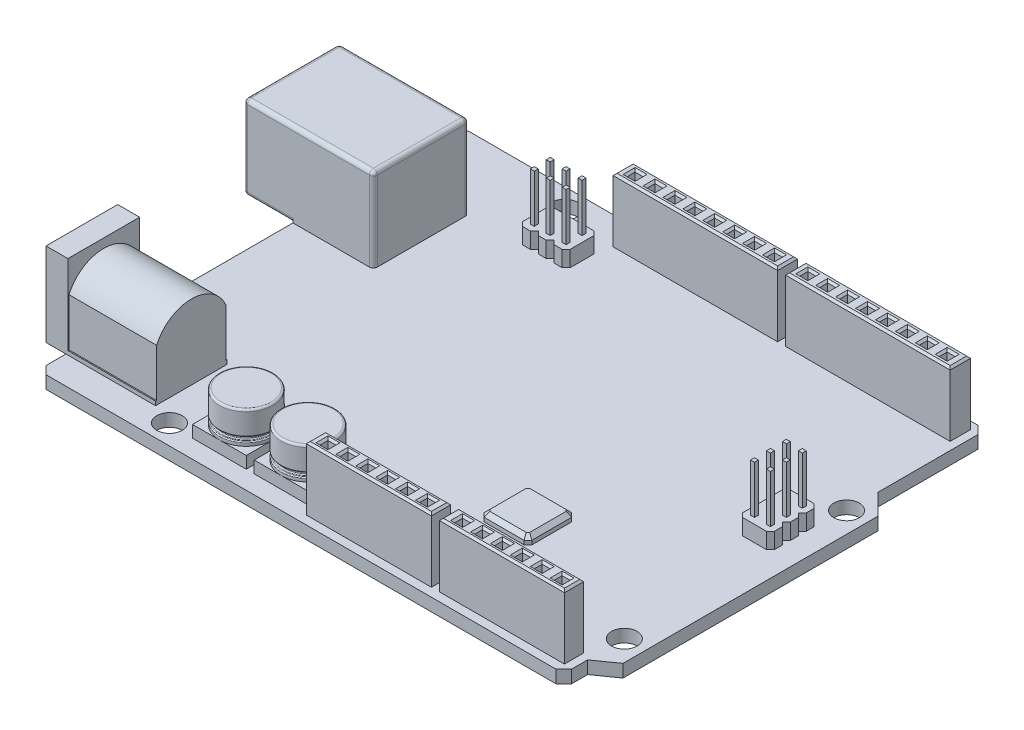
from build123d import *

# Parameters (mm, degrees)
SKETCH1_R           = 1.6
BOSS_EXTRUDE1_DEPTH = 1.6
CHAMFER1_SIZE       = 1
SKETCH2_W           = 16.3
SKETCH2_H           = 12
SKETCH2_W_2         = 13.75
SKETCH2_H_2         = 9
BOSS_EXTRUDE2_DEPTH = 10.5
CUT_EXTRUDE1_DEPTH  = 10
FILLET2_R           = 0.5
SKETCH4_R           = 3.5
SKETCH4_R_2         = 0.5
CUT_EXTRUDE2_DEPTH  = 10
CUT_EXTRUDE5_DEPTH  = 11
FILLET3_R           = 0.5
SKETCH7_W           = 20.65
SKETCH7_H           = 2.5
SKETCH7_W_2         = 1
SKETCH7_H_2         = 1
SKETCH7_H_3         = 2.565649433
SKETCH7_W_3         = 15.7
SKETCH7_H_4         = 2.414728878
BOSS_EXTRUDE3_DEPTH = 8
CHAMFER2_SIZE       = 0.25
SKETCH8_W           = 6.75
SKETCH8_H           = 6.75
BOSS_EXTRUDE4_DEPTH = 1.5
SKETCH9_R           = 3.375
BOSS_EXTRUDE5_DEPTH = 4
FILLET4_R           = 0.25
CUT_EXTRUDE6_START  = -0.5
SKETCH10_R          = 3.375
SKETCH10_R_2        = 3
CUT_EXTRUDE6_DEPTH  = 0.5
FILLET5_R           = 0.125
BOSS_EXTRUDE6_DEPTH = 2
SKETCH12_W          = 0.5
SKETCH12_H          = 0.5
BOSS_EXTRUDE7_DEPTH = 6
SKETCH13_W          = 6
SKETCH13_H          = 6
BOSS_EXTRUDE8_DEPTH = 1
CHAMFER3_SIZE       = 0.5
CHAMFER4_SIZE       = 0.5


with BuildPart() as part:
    # Sketch1 → Boss-Extrude1 (new body)
    with BuildSketch(Plane(origin=(0, 0, 0), x_dir=(1, 0, 0), z_dir=(0, 1, 0))):
        Polygon((33, 12.933424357), (35.6, 10.333424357), (35.6, -21.666575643), (33, -23.5), (33, -26.5), (-33, -26.5), (-33, 26.5), (33, 26.5), align=None)
        with Locations(Location((-17.4, 24, 0), (0, 0, 270))):
            Circle(SKETCH1_R, mode=Mode.SUBTRACT)
        with Locations(Location((-19, -24, 0), (0, 0, 270))):
            Circle(SKETCH1_R, mode=Mode.SUBTRACT)
        with Locations(Location((33, 9, 0), (0, 0, 270))):
            Circle(SKETCH1_R, mode=Mode.SUBTRACT)
        with Locations(Location((33, -18.9, 0), (0, 0, 270))):
            Circle(SKETCH1_R, mode=Mode.SUBTRACT)
    extrude(amount=BOSS_EXTRUDE1_DEPTH)

    # Chamfer1
    chamfer1_edges = [part.edges().sort_by_distance(p)[0] for p in [
        (33, 0.8, 26.5),
        (-33, 0.8, 26.5),
        (-33, 0.8, -26.5),
        (33, 0.8, -26.5),
    ]]
    chamfer(chamfer1_edges, length=CHAMFER1_SIZE)

    # Sketch2 → Boss-Extrude2 (add)
    with BuildSketch(Plane(origin=(0, 1.6, 0), x_dir=(1, 0, 0), z_dir=(0, 1, 0))):
        with Locations((-31.05, 11.5)):
            Rectangle(SKETCH2_W, SKETCH2_H)
        with Locations((-28.625, -18.5)):
            Rectangle(SKETCH2_W_2, SKETCH2_H_2)
    extrude(amount=BOSS_EXTRUDE2_DEPTH)

    # Sketch3 → Cut-Extrude1 (cut)
    with BuildSketch(Plane.ZY.offset(39.2)):
        Polygon((-9.160529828, 10.6), (-13.839470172, 10.6), (-16, 8.151795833), (-16, 3.1), (-7, 3.1), (-7, 8.151795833), align=None)
        Polygon((-8.81, 8.151795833), (-14.19, 8.151795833), (-14.19, 5.651795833), (-11.5, 5.651795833), (-8.81, 5.651795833), align=None, mode=Mode.SUBTRACT)
    extrude(amount=-CUT_EXTRUDE1_DEPTH, mode=Mode.SUBTRACT)

    # Fillet2
    fillet2_edges = [part.edges().sort_by_distance(p)[0] for p in [
        (-36.1, 1.6, -17.5),
        (-39.2, 1.6, -11.5),
        (-36.1, 1.6, -5.5),
        (-22.9, 12.1, -11.5),
        (-31.05, 12.1, -17.5),
        (-39.2, 12.1, -11.5),
        (-22.9, 6.85, -5.5),
        (-39.2, 6.85, -5.5),
        (-39.2, 6.85, -17.5),
        (-22.9, 6.85, -17.5),
        (-31.05, 12.1, -5.5),
    ]]
    fillet(fillet2_edges, radius=FILLET2_R)

    # Sketch4 → Cut-Extrude2 (cut)
    with BuildSketch(Plane.ZY.offset(35.5)):
        with Locations((18.5, 6.85)):
            Circle(SKETCH4_R)
        with Locations((18.5, 6.85)):
            Circle(SKETCH4_R_2, mode=Mode.SUBTRACT)
    extrude(amount=-CUT_EXTRUDE2_DEPTH, mode=Mode.SUBTRACT)

    # Sketch6 → Cut-Extrude5 (cut)
    with BuildSketch(Plane(origin=(-21.75, 0, 0), x_dir=(0, 0, -1), z_dir=(1, 0, 0))):
        with BuildLine():
            Line((-14, 12.1), (-23, 12.1))
            Line((-23, 12.1), (-23, 2.1))
            Line((-23, 2.1), (-22.86, 2.1))
            Line((-22.86, 2.1), (-22.86, 8.1))
            ThreePointArc((-22.86, 8.1), (-18.5, 10.959725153), (-14.14, 8.1))
            Line((-14.14, 8.1), (-14.14, 2.1))
            Line((-14.14, 2.1), (-14, 2.1))
            Line((-14, 2.1), (-14, 12.1))
        make_face()
    extrude(amount=-CUT_EXTRUDE5_DEPTH, mode=Mode.SUBTRACT)

    # Fillet3
    fillet3_edges = [part.edges().sort_by_distance(p)[0] for p in [
        (-35.5, 6.85, 18),
    ]]
    fillet(fillet3_edges, radius=FILLET3_R)

    # Sketch7 → Boss-Extrude3 (add)
    # profile 1 of 4: a face of its own
    with BuildSketch(Plane(origin=(0, 1.6, 0), x_dir=(1, 0, 0), z_dir=(0, 1, 0))):
        with Locations((0.025, 24.25)):
            Rectangle(SKETCH7_W, SKETCH7_H)
        with Locations((-6.3, 24.25)):
            Rectangle(SKETCH7_W_2, SKETCH7_H_2, mode=Mode.SUBTRACT)
        with Locations((-8.8, 24.25)):
            Rectangle(SKETCH7_W_2, SKETCH7_H_2, mode=Mode.SUBTRACT)
        with Locations((-3.8, 24.25)):
            Rectangle(SKETCH7_W_2, SKETCH7_H_2, mode=Mode.SUBTRACT)
        with Locations((-1.3, 24.25)):
            Rectangle(SKETCH7_W_2, SKETCH7_H_2, mode=Mode.SUBTRACT)
        with Locations((1.2, 24.25)):
            Rectangle(SKETCH7_W_2, SKETCH7_H_2, mode=Mode.SUBTRACT)
        with Locations((3.7, 24.25)):
            Rectangle(SKETCH7_W_2, SKETCH7_H_2, mode=Mode.SUBTRACT)
        with Locations((6.2, 24.25)):
            Rectangle(SKETCH7_W_2, SKETCH7_H_2, mode=Mode.SUBTRACT)
        with Locations((8.7, 24.25)):
            Rectangle(SKETCH7_W_2, SKETCH7_H_2, mode=Mode.SUBTRACT)
    # profile 2 of 4: a face of its own
    with BuildSketch(Plane(origin=(0, 1.6, 0), x_dir=(1, 0, 0), z_dir=(0, 1, 0))):
        with Locations((21.675, 24.282824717)):
            Rectangle(SKETCH7_W, SKETCH7_H_3)
        with Locations((15.35, 24.282824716)):
            Rectangle(SKETCH7_W_2, SKETCH7_H_2, mode=Mode.SUBTRACT)
        with Locations((12.85, 24.282824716)):
            Rectangle(SKETCH7_W_2, SKETCH7_H_2, mode=Mode.SUBTRACT)
        with Locations((17.85, 24.282824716)):
            Rectangle(SKETCH7_W_2, SKETCH7_H_2, mode=Mode.SUBTRACT)
        with Locations((20.35, 24.282824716)):
            Rectangle(SKETCH7_W_2, SKETCH7_H_2, mode=Mode.SUBTRACT)
        with Locations((22.85, 24.282824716)):
            Rectangle(SKETCH7_W_2, SKETCH7_H_2, mode=Mode.SUBTRACT)
        with Locations((25.35, 24.282824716)):
            Rectangle(SKETCH7_W_2, SKETCH7_H_2, mode=Mode.SUBTRACT)
        with Locations((27.85, 24.282824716)):
            Rectangle(SKETCH7_W_2, SKETCH7_H_2, mode=Mode.SUBTRACT)
        with Locations((30.35, 24.282824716)):
            Rectangle(SKETCH7_W_2, SKETCH7_H_2, mode=Mode.SUBTRACT)
    # profile 3 of 4: a face of its own
    with BuildSketch(Plane(origin=(0, 1.6, 0), x_dir=(1, 0, 0), z_dir=(0, 1, 0))):
        with Locations((7.45, -24.207364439)):
            Rectangle(SKETCH7_W_3, SKETCH7_H_4)
        with Locations((3.6, -24.207364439)):
            Rectangle(SKETCH7_W_2, SKETCH7_H_2, mode=Mode.SUBTRACT)
        with Locations((1.1, -24.207364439)):
            Rectangle(SKETCH7_W_2, SKETCH7_H_2, mode=Mode.SUBTRACT)
        with Locations((6.1, -24.207364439)):
            Rectangle(SKETCH7_W_2, SKETCH7_H_2, mode=Mode.SUBTRACT)
        with Locations((8.6, -24.207364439)):
            Rectangle(SKETCH7_W_2, SKETCH7_H_2, mode=Mode.SUBTRACT)
        with Locations((11.1, -24.207364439)):
            Rectangle(SKETCH7_W_2, SKETCH7_H_2, mode=Mode.SUBTRACT)
        with Locations((13.6, -24.207364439)):
            Rectangle(SKETCH7_W_2, SKETCH7_H_2, mode=Mode.SUBTRACT)
    # profile 4 of 4: a face of its own
    with BuildSketch(Plane(origin=(0, 1.6, 0), x_dir=(1, 0, 0), z_dir=(0, 1, 0))):
        with Locations((24.15, -24.207364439)):
            Rectangle(SKETCH7_W_3, SKETCH7_H_4)
        with Locations((18, -24.207364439)):
            Rectangle(SKETCH7_W_2, SKETCH7_H_2, mode=Mode.SUBTRACT)
        with Locations((20.5, -24.207364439)):
            Rectangle(SKETCH7_W_2, SKETCH7_H_2, mode=Mode.SUBTRACT)
        with Locations((23, -24.207364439)):
            Rectangle(SKETCH7_W_2, SKETCH7_H_2, mode=Mode.SUBTRACT)
        with Locations((25.5, -24.207364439)):
            Rectangle(SKETCH7_W_2, SKETCH7_H_2, mode=Mode.SUBTRACT)
        with Locations((28, -24.207364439)):
            Rectangle(SKETCH7_W_2, SKETCH7_H_2, mode=Mode.SUBTRACT)
        with Locations((30.5, -24.207364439)):
            Rectangle(SKETCH7_W_2, SKETCH7_H_2, mode=Mode.SUBTRACT)
    extrude(amount=BOSS_EXTRUDE3_DEPTH)

    # Chamfer2
    chamfer2_edges = [part.edges().sort_by_distance(p)[0] for p in [
        (13.6, 9.6, 24.707364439),
        (14.1, 9.6, 24.207364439),
        (13.6, 9.6, 23.707364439),
        (13.1, 9.6, 24.207364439),
        (11.1, 9.6, 24.707364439),
        (11.6, 9.6, 24.207364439),
        (11.1, 9.6, 23.707364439),
        (10.6, 9.6, 24.207364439),
        (8.6, 9.6, 24.707364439),
        (9.1, 9.6, 24.207364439),
        (8.6, 9.6, 23.707364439),
        (8.1, 9.6, 24.207364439),
        (6.1, 9.6, 24.707364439),
        (6.6, 9.6, 24.207364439),
        (6.1, 9.6, 23.707364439),
        (5.6, 9.6, 24.207364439),
        (3.6, 9.6, 24.707364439),
        (4.1, 9.6, 24.207364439),
        (3.6, 9.6, 23.707364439),
        (3.1, 9.6, 24.207364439),
        (1.6, 9.6, 24.207364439),
        (1.1, 9.6, 23.707364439),
        (0.6, 9.6, 24.207364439),
        (1.1, 9.6, 24.707364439),
        (7.45, 9.6, 23),
        (15.3, 9.6, 24.207364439),
        (7.45, 9.6, 25.414728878),
        (-0.4, 9.6, 24.207364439),
        (30, 9.6, 24.207364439),
        (30.5, 9.6, 24.707364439),
        (31, 9.6, 24.207364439),
        (30.5, 9.6, 23.707364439),
        (27.5, 9.6, 24.207364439),
        (28, 9.6, 24.707364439),
        (28.5, 9.6, 24.207364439),
        (28, 9.6, 23.707364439),
        (25, 9.6, 24.207364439),
        (25.5, 9.6, 24.707364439),
        (26, 9.6, 24.207364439),
        (25.5, 9.6, 23.707364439),
        (22.5, 9.6, 24.207364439),
        (23, 9.6, 24.707364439),
        (23.5, 9.6, 24.207364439),
        (23, 9.6, 23.707364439),
        (20, 9.6, 24.207364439),
        (20.5, 9.6, 24.707364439),
        (21, 9.6, 24.207364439),
        (20.5, 9.6, 23.707364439),
        (17.5, 9.6, 24.207364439),
        (18, 9.6, 24.707364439),
        (18.5, 9.6, 24.207364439),
        (18, 9.6, 23.707364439),
        (24.15, 9.6, 23),
        (32, 9.6, 24.207364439),
        (24.15, 9.6, 25.414728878),
        (16.3, 9.6, 24.207364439),
        (30.35, 9.6, -23.782824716),
        (30.85, 9.6, -24.282824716),
        (30.35, 9.6, -24.782824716),
        (29.85, 9.6, -24.282824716),
        (27.85, 9.6, -23.782824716),
        (28.35, 9.6, -24.282824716),
        (27.85, 9.6, -24.782824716),
        (27.35, 9.6, -24.282824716),
        (25.35, 9.6, -23.782824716),
        (25.85, 9.6, -24.282824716),
        (25.35, 9.6, -24.782824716),
        (24.85, 9.6, -24.282824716),
        (22.85, 9.6, -23.782824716),
        (23.35, 9.6, -24.282824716),
        (22.85, 9.6, -24.782824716),
        (22.35, 9.6, -24.282824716),
        (20.35, 9.6, -23.782824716),
        (20.85, 9.6, -24.282824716),
        (20.35, 9.6, -24.782824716),
        (19.85, 9.6, -24.282824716),
        (17.85, 9.6, -23.782824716),
        (18.35, 9.6, -24.282824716),
        (17.85, 9.6, -24.782824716),
        (17.35, 9.6, -24.282824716),
        (15.35, 9.6, -23.782824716),
        (15.85, 9.6, -24.282824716),
        (15.35, 9.6, -24.782824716),
        (14.85, 9.6, -24.282824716),
        (13.35, 9.6, -24.282824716),
        (12.85, 9.6, -24.782824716),
        (12.35, 9.6, -24.282824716),
        (12.85, 9.6, -23.782824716),
        (21.675, 9.6, -25.565649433),
        (32, 9.6, -24.282824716),
        (21.675, 9.6, -23),
        (11.35, 9.6, -24.282824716),
        (8.7, 9.6, -23.75),
        (9.2, 9.6, -24.25),
        (8.7, 9.6, -24.75),
        (8.2, 9.6, -24.25),
        (6.2, 9.6, -23.75),
        (6.7, 9.6, -24.25),
        (6.2, 9.6, -24.75),
        (5.7, 9.6, -24.25),
        (3.7, 9.6, -23.75),
        (4.2, 9.6, -24.25),
        (3.7, 9.6, -24.75),
        (3.2, 9.6, -24.25),
        (1.2, 9.6, -23.75),
        (1.7, 9.6, -24.25),
        (1.2, 9.6, -24.75),
        (0.7, 9.6, -24.25),
        (-1.3, 9.6, -23.75),
        (-0.8, 9.6, -24.25),
        (-1.3, 9.6, -24.75),
        (-1.8, 9.6, -24.25),
        (-3.8, 9.6, -23.75),
        (-3.3, 9.6, -24.25),
        (-3.8, 9.6, -24.75),
        (-4.3, 9.6, -24.25),
        (-6.3, 9.6, -23.75),
        (-5.8, 9.6, -24.25),
        (-6.3, 9.6, -24.75),
        (-6.8, 9.6, -24.25),
        (-8.3, 9.6, -24.25),
        (-8.8, 9.6, -24.75),
        (-9.3, 9.6, -24.25),
        (-8.8, 9.6, -23.75),
        (0.025, 9.6, -25.5),
        (10.35, 9.6, -24.25),
        (0.025, 9.6, -23),
        (-10.3, 9.6, -24.25),
    ]]
    chamfer(chamfer2_edges, length=CHAMFER2_SIZE)

    # Sketch8 → Boss-Extrude4 (add)
    with BuildSketch(Plane(origin=(0, 1.6, 0), x_dir=(1, 0, 0), z_dir=(0, 1, 0))):
        with Locations((-4.775, -20.832364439)):
            Rectangle(SKETCH8_W, SKETCH8_H)
        with Locations((-12.525, -20.832364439)):
            Rectangle(SKETCH8_W, SKETCH8_H)
    extrude(amount=BOSS_EXTRUDE4_DEPTH)

    # Sketch9 → Boss-Extrude5 (add)
    with BuildSketch(Plane(origin=(0, 3.1, 0), x_dir=(1, 0, 0), z_dir=(0, 1, 0))):
        with Locations(Location((-12.525, -20.832364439, 0), (0, 0, 270))):
            Circle(SKETCH9_R)
        with Locations(Location((-4.775, -20.832364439, 0), (0, 0, 270))):
            Circle(SKETCH9_R)
    extrude(amount=BOSS_EXTRUDE5_DEPTH)

    # Fillet4
    fillet4_edges = [part.edges().sort_by_distance(p)[0] for p in [
        (-12.525, 7.1, 17.457364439),
        (-4.775, 7.1, 17.457364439),
    ]]
    fillet(fillet4_edges, radius=FILLET4_R)

    # Sketch10 → Cut-Extrude6 (cut)
    # profile 1 of 2: a face of its own
    with BuildSketch(Plane(origin=(0, 4.1, 0), x_dir=(1, 0, 0), z_dir=(0, 1, 0)).offset(CUT_EXTRUDE6_START)):
        with Locations(Location((-4.775, -20.832364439, 0), (0, 0, 270))):
            Circle(SKETCH10_R)
        with Locations(Location((-4.775, -20.832364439, 0), (0, 0, 270))):
            Circle(SKETCH10_R_2, mode=Mode.SUBTRACT)
    # profile 2 of 2: a face of its own
    with BuildSketch(Plane(origin=(0, 4.1, 0), x_dir=(1, 0, 0), z_dir=(0, 1, 0)).offset(CUT_EXTRUDE6_START)):
        with Locations(Location((-12.525, -20.832364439, 0), (0, 0, 90))):
            Circle(SKETCH10_R)
        with Locations(Location((-12.525, -20.832364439, 0), (0, 0, 90))):
            Circle(SKETCH10_R_2, mode=Mode.SUBTRACT)
    extrude(amount=CUT_EXTRUDE6_DEPTH, mode=Mode.SUBTRACT)

    # Fillet5
    fillet5_edges = [part.edges().sort_by_distance(p)[0] for p in [
        (-4.775, 3.6, 17.457364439),
        (-4.775, 3.6, 17.832364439),
        (-4.775, 4.1, 17.457364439),
        (-4.775, 4.1, 17.832364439),
        (-12.525, 3.6, 17.457364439),
        (-12.525, 3.6, 23.832364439),
        (-12.525, 4.1, 17.457364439),
        (-12.525, 4.1, 23.832364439),
    ]]
    fillet(fillet5_edges, radius=FILLET5_R)

    # Sketch11 → Boss-Extrude6 (add)
    with BuildSketch(Plane(origin=(0, 1.6, 0), x_dir=(1, 0, 0), z_dir=(0, 1, 0))):
        Polygon((29.239442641, 5.700694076), (28.739442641, 5.200694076), (28.739442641, 4.200694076), (29.239442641, 3.700694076), (28.739442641, 3.200694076), (28.739442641, 2.200694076), (29.239442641, 1.700694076), (28.739442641, 1.200694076), (28.739442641, 0.200694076), (29.239442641, -0.299305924), (32.239442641, -0.299305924), (32.739442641, 0.200694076), (32.739442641, 1.200694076), (32.239442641, 1.700694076), (32.739442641, 2.200694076), (32.739442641, 3.200694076), (32.239442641, 3.700694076), (32.739442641, 4.200694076), (32.739442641, 5.200694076), (32.239442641, 5.700694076), align=None)
        Polygon((-16.231707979, 21.527662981), (-16.731707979, 21.027662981), (-16.731707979, 18.027662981), (-16.231707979, 17.527662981), (-15.231707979, 17.527662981), (-14.731707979, 18.027662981), (-14.231707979, 17.527662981), (-13.231707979, 17.527662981), (-12.731707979, 18.027662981), (-12.231707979, 17.527662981), (-11.231707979, 17.527662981), (-10.731707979, 18.027662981), (-10.731707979, 21.027662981), (-11.231707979, 21.527662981), (-12.231707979, 21.527662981), (-12.731707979, 21.027662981), (-13.231707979, 21.527662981), (-14.231707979, 21.527662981), (-14.731707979, 21.027662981), (-15.231707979, 21.527662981), align=None)
    extrude(amount=BOSS_EXTRUDE6_DEPTH)

    # Sketch12 → Boss-Extrude7 (add)
    with BuildSketch(Plane(origin=(0, 3.6, 0), x_dir=(1, 0, 0), z_dir=(0, 1, 0))):
        with Locations((29.739442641, 4.700694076)):
            Rectangle(SKETCH12_W, SKETCH12_H)
        with Locations((31.739442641, 4.700694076)):
            Rectangle(SKETCH12_W, SKETCH12_H)
        with Locations((31.739442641, 2.700694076)):
            Rectangle(SKETCH12_W, SKETCH12_H)
        with Locations((29.739442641, 2.700694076)):
            Rectangle(SKETCH12_W, SKETCH12_H)
        with Locations((31.739442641, 0.700694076)):
            Rectangle(SKETCH12_W, SKETCH12_H)
        with Locations((29.739442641, 0.700694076)):
            Rectangle(SKETCH12_W, SKETCH12_H)
        with Locations((-15.731707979, 18.527662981)):
            Rectangle(SKETCH12_W, SKETCH12_H)
        with Locations((-15.731707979, 20.527662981)):
            Rectangle(SKETCH12_W, SKETCH12_H)
        with Locations((-13.731707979, 18.527662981)):
            Rectangle(SKETCH12_W, SKETCH12_H)
        with Locations((-13.731707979, 20.527662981)):
            Rectangle(SKETCH12_W, SKETCH12_H)
        with Locations((-11.731707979, 18.527662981)):
            Rectangle(SKETCH12_W, SKETCH12_H)
        with Locations((-11.731707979, 20.527662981)):
            Rectangle(SKETCH12_W, SKETCH12_H)
    extrude(amount=BOSS_EXTRUDE7_DEPTH)

    # Sketch13 → Boss-Extrude8 (add)
    with BuildSketch(Plane(origin=(0, 1.6, 0), x_dir=(1, 0, 0), z_dir=(0, 1, 0))):
        with Locations((14, -12)):
            Rectangle(SKETCH13_W, SKETCH13_H)
    extrude(amount=BOSS_EXTRUDE8_DEPTH)

    # Chamfer3
    chamfer3_edges = [part.edges().sort_by_distance(p)[0] for p in [
        (17, 2.1, 9),
        (11, 2.1, 9),
        (11, 2.1, 15),
        (17, 2.1, 15),
    ]]
    chamfer(chamfer3_edges, length=CHAMFER3_SIZE)

    # Chamfer4
    chamfer4_edges = [part.edges().sort_by_distance(p)[0] for p in [
        (14, 2.6, 15),
        (11, 2.6, 12),
        (14, 2.6, 9),
        (17, 2.6, 12),
        (11.25, 2.6, 9.25),
        (16.75, 2.6, 9.25),
        (16.75, 2.6, 14.75),
        (11.25, 2.6, 14.75),
    ]]
    chamfer(chamfer4_edges, length=CHAMFER4_SIZE)


solid = part.part
